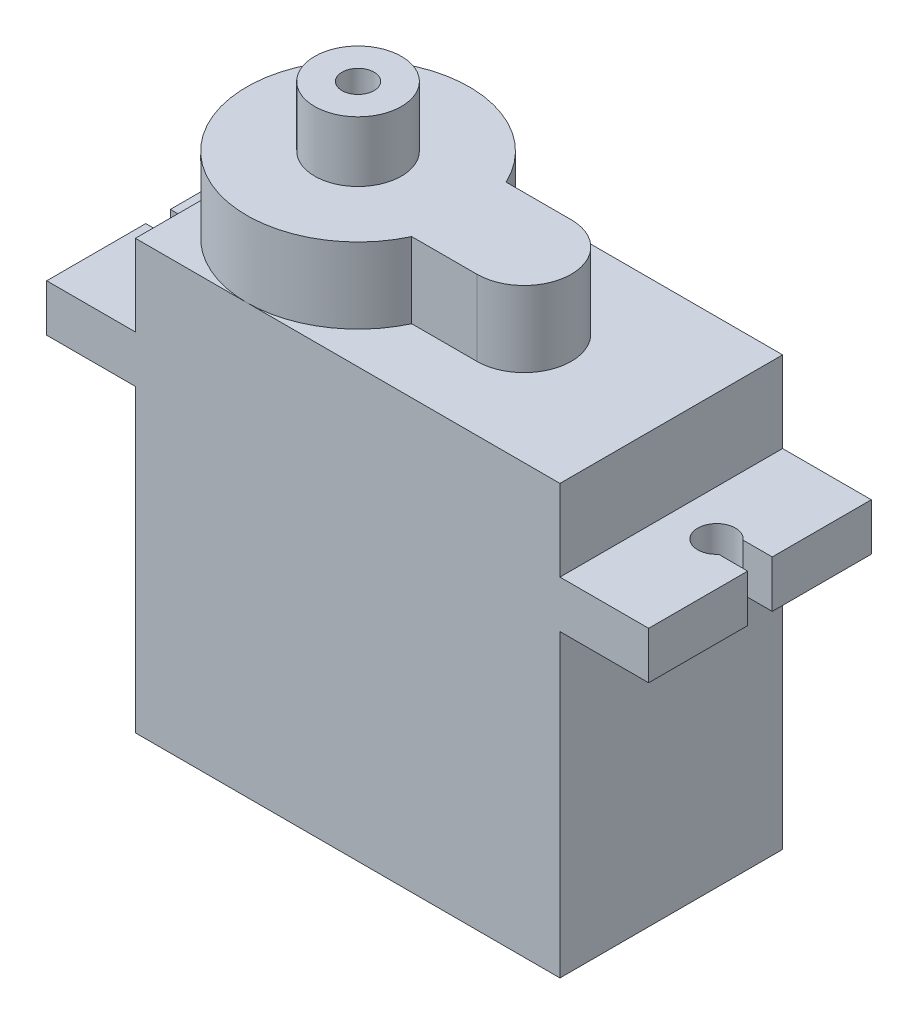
from build123d import *

# Parameters (mm, degrees)
SKETCH2_W           = 22.5
SKETCH2_H           = 22.7
BOSS_EXTRUDE1_DEPTH = 5.9
BOSS_EXTRUDE2_DEPTH = 2.5
BOSS_EXTRUDE3_DEPTH = 4
SKETCH5_R           = 2.3
SKETCH5_R_2         = 0.85
BOSS_EXTRUDE4_DEPTH = 3.2


with BuildPart() as part:
    # Sketch2 → Boss-Extrude1 (new, symmetric)
    with BuildSketch(Plane.XY):
        Rectangle(SKETCH2_W, SKETCH2_H)
    extrude(amount=BOSS_EXTRUDE1_DEPTH, both=True)

    # Sketch3 → Boss-Extrude2 (add)
    with BuildSketch(Plane(origin=(0, 4.55, 0), x_dir=(-1, 0, 0), z_dir=(0, -1, 0))):
        with BuildLine():
            Line((14.409934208, 0.65), (15.95, 0.65))
            Line((15.95, 0.65), (15.95, 5.9))
            Line((15.95, 5.9), (11.25, 5.9))
            Line((11.25, 5.9), (11.25, -5.9))
            Line((11.25, -5.9), (15.95, -5.9))
            Line((15.95, -5.9), (15.95, -0.65))
            Line((15.95, -0.65), (14.409934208, -0.65))
            ThreePointArc((14.409934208, -0.65), (12.65, 0), (14.409934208, 0.65))
        make_face()
        with BuildLine():
            Line((-11.25, -5.9), (-15.95, -5.9))
            Line((-15.95, -5.9), (-15.95, -0.65))
            Line((-15.95, -0.65), (-14.409934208, -0.65))
            ThreePointArc((-14.409934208, -0.65), (-12.65, 0), (-14.409934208, 0.65))
            Line((-14.409934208, 0.65), (-15.95, 0.65))
            Line((-15.95, 0.65), (-15.95, 5.9))
            Line((-15.95, 5.9), (-11.25, 5.9))
            Line((-11.25, 5.9), (-11.25, -5.9))
        make_face()
    extrude(amount=-BOSS_EXTRUDE2_DEPTH)

    # Sketch4 → Boss-Extrude3 (add)
    with BuildSketch(Plane(origin=(0, 11.35, 0), x_dir=(1, 0, 0), z_dir=(0, 1, 0))):
        with BuildLine():
            Line((3.45, 2.5), (-0.005844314, 2.5))
            ThreePointArc((-0.005844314, 2.5), (-11.25, 0), (-0.005844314, -2.5))
            Line((-0.005844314, -2.5), (3.45, -2.5))
            ThreePointArc((3.45, -2.5), (5.95, 0), (3.45, 2.5))
        make_face()
    extrude(amount=BOSS_EXTRUDE3_DEPTH)

    # Sketch5 → Boss-Extrude4 (add)
    with BuildSketch(Plane(origin=(0, 15.35, 0), x_dir=(1, 0, 0), z_dir=(0, 1, 0))):
        with Locations(Location((-5.35, 0, 0), (0, 0, 180))):
            Circle(SKETCH5_R)
        with Locations(Location((-5.35, 0, 0), (0, 0, 180))):
            Circle(SKETCH5_R_2, mode=Mode.SUBTRACT)
    extrude(amount=BOSS_EXTRUDE4_DEPTH)


solid = part.part
